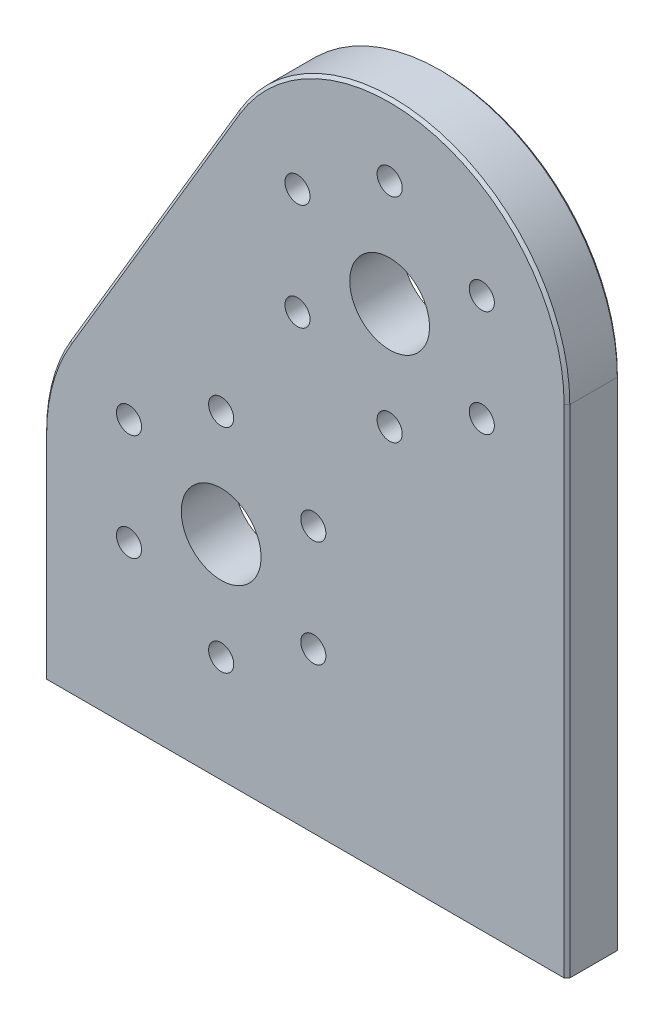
ISO-10303-21;
HEADER;
FILE_DESCRIPTION(('STEP AP214'),'2;1');
FILE_NAME('part.step','',(''),(''),'','','');
FILE_SCHEMA(('AUTOMOTIVE_DESIGN { 1 0 10303 214 1 1 1 1 }'));
ENDSEC;
DATA;
#1=APPLICATION_CONTEXT('core data for automotive mechanical design processes');
#2=APPLICATION_PROTOCOL_DEFINITION('international standard','automotive_design',2000,#1);
#3=PRODUCT_CONTEXT('',#1,'mechanical');
#4=PRODUCT('Part','Part','',(#3));
#5=PRODUCT_RELATED_PRODUCT_CATEGORY('part','',(#4));
#6=PRODUCT_DEFINITION_FORMATION('','',#4);
#7=PRODUCT_DEFINITION_CONTEXT('part definition',#1,'design');
#8=PRODUCT_DEFINITION('design','',#6,#7);
#9=PRODUCT_DEFINITION_SHAPE('','',#8);
#10=(LENGTH_UNIT() NAMED_UNIT(*) SI_UNIT(.MILLI.,.METRE.));
#11=(NAMED_UNIT(*) PLANE_ANGLE_UNIT() SI_UNIT($,.RADIAN.));
#12=(NAMED_UNIT(*) SI_UNIT($,.STERADIAN.) SOLID_ANGLE_UNIT());
#13=UNCERTAINTY_MEASURE_WITH_UNIT(LENGTH_MEASURE(1.E-05),#10,'distance_accuracy_value','');
#14=(GEOMETRIC_REPRESENTATION_CONTEXT(3) GLOBAL_UNCERTAINTY_ASSIGNED_CONTEXT((#13)) GLOBAL_UNIT_ASSIGNED_CONTEXT((#10,
#11,#12)) REPRESENTATION_CONTEXT('',''));
#15=CARTESIAN_POINT('',(0.,0.,0.));
#16=DIRECTION('',(0.,0.,1.));
#17=DIRECTION('',(1.,0.,0.));
#18=AXIS2_PLACEMENT_3D('',#15,#16,#17);
#19=CARTESIAN_POINT('',(30.1625,88.9,4.7625));
#20=DIRECTION('',(0.,0.,1.));
#21=DIRECTION('',(1.,0.,0.));
#22=AXIS2_PLACEMENT_3D('',#19,#20,#21);
#23=PLANE('',#22);
#24=CARTESIAN_POINT('',(30.1625,69.85,4.7625));
#25=DIRECTION('',(0.,0.,1.));
#26=DIRECTION('',(1.,0.,0.));
#27=AXIS2_PLACEMENT_3D('',#24,#25,#26);
#28=CIRCLE('',#27,2.24789999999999);
#29=CARTESIAN_POINT('',(32.4104,69.85,4.7625));
#30=VERTEX_POINT('',#29);
#31=EDGE_CURVE('E472',#30,#30,#28,.T.);
#32=ORIENTED_EDGE('',*,*,#31,.F.);
#33=EDGE_LOOP('',(#32));
#34=FACE_BOUND('',#33,.T.);
#35=CARTESIAN_POINT('',(13.6647160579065,79.375,4.7625));
#36=DIRECTION('',(0.,0.,1.));
#37=DIRECTION('',(1.,0.,0.));
#38=AXIS2_PLACEMENT_3D('',#35,#36,#37);
#39=CIRCLE('',#38,2.24789999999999);
#40=CARTESIAN_POINT('',(15.9126160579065,79.375,4.7625));
#41=VERTEX_POINT('',#40);
#42=EDGE_CURVE('E478',#41,#41,#39,.T.);
#43=ORIENTED_EDGE('',*,*,#42,.F.);
#44=EDGE_LOOP('',(#43));
#45=FACE_BOUND('',#44,.T.);
#46=CARTESIAN_POINT('',(46.6602839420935,98.425,4.7625));
#47=DIRECTION('',(0.,0.,1.));
#48=DIRECTION('',(1.,0.,0.));
#49=AXIS2_PLACEMENT_3D('',#46,#47,#48);
#50=CIRCLE('',#49,2.24789999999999);
#51=CARTESIAN_POINT('',(48.9081839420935,98.425,4.7625));
#52=VERTEX_POINT('',#51);
#53=EDGE_CURVE('E484',#52,#52,#50,.T.);
#54=ORIENTED_EDGE('',*,*,#53,.F.);
#55=EDGE_LOOP('',(#54));
#56=FACE_BOUND('',#55,.T.);
#57=CARTESIAN_POINT('',(30.1625,107.95,4.7625));
#58=DIRECTION('',(0.,0.,1.));
#59=DIRECTION('',(1.,0.,0.));
#60=AXIS2_PLACEMENT_3D('',#57,#58,#59);
#61=CIRCLE('',#60,2.24789999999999);
#62=CARTESIAN_POINT('',(32.4104,107.95,4.7625));
#63=VERTEX_POINT('',#62);
#64=EDGE_CURVE('E490',#63,#63,#61,.T.);
#65=ORIENTED_EDGE('',*,*,#64,.F.);
#66=EDGE_LOOP('',(#65));
#67=FACE_BOUND('',#66,.T.);
#68=CARTESIAN_POINT('',(13.6647160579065,98.425,4.7625));
#69=DIRECTION('',(0.,0.,1.));
#70=DIRECTION('',(1.,0.,0.));
#71=AXIS2_PLACEMENT_3D('',#68,#69,#70);
#72=CIRCLE('',#71,2.24789999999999);
#73=CARTESIAN_POINT('',(15.9126160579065,98.425,4.7625));
#74=VERTEX_POINT('',#73);
#75=EDGE_CURVE('E496',#74,#74,#72,.T.);
#76=ORIENTED_EDGE('',*,*,#75,.F.);
#77=EDGE_LOOP('',(#76));
#78=FACE_BOUND('',#77,.T.);
#79=CARTESIAN_POINT('',(46.6602839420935,79.375,4.7625));
#80=DIRECTION('',(0.,0.,1.));
#81=DIRECTION('',(1.,0.,0.));
#82=AXIS2_PLACEMENT_3D('',#79,#80,#81);
#83=CIRCLE('',#82,2.24789999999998);
#84=CARTESIAN_POINT('',(48.9081839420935,79.375,4.7625));
#85=VERTEX_POINT('',#84);
#86=EDGE_CURVE('E502',#85,#85,#83,.T.);
#87=ORIENTED_EDGE('',*,*,#86,.F.);
#88=EDGE_LOOP('',(#87));
#89=FACE_BOUND('',#88,.T.);
#90=CARTESIAN_POINT('',(16.4977839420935,47.625,4.7625));
#91=DIRECTION('',(0.,0.,1.));
#92=DIRECTION('',(1.,0.,0.));
#93=AXIS2_PLACEMENT_3D('',#90,#91,#92);
#94=CIRCLE('',#93,2.24789999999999);
#95=CARTESIAN_POINT('',(18.7456839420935,47.625,4.7625));
#96=VERTEX_POINT('',#95);
#97=EDGE_CURVE('E508',#96,#96,#94,.T.);
#98=ORIENTED_EDGE('',*,*,#97,.F.);
#99=EDGE_LOOP('',(#98));
#100=FACE_BOUND('',#99,.T.);
#101=CARTESIAN_POINT('',(16.4977839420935,28.575,4.7625));
#102=DIRECTION('',(0.,0.,1.));
#103=DIRECTION('',(1.,0.,0.));
#104=AXIS2_PLACEMENT_3D('',#101,#102,#103);
#105=CIRCLE('',#104,2.24789999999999);
#106=CARTESIAN_POINT('',(18.7456839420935,28.575,4.7625));
#107=VERTEX_POINT('',#106);
#108=EDGE_CURVE('E514',#107,#107,#105,.T.);
#109=ORIENTED_EDGE('',*,*,#108,.F.);
#110=EDGE_LOOP('',(#109));
#111=FACE_BOUND('',#110,.T.);
#112=CARTESIAN_POINT('',(0.,57.15,4.7625));
#113=DIRECTION('',(0.,0.,1.));
#114=DIRECTION('',(1.,0.,0.));
#115=AXIS2_PLACEMENT_3D('',#112,#113,#114);
#116=CIRCLE('',#115,2.24789999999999);
#117=CARTESIAN_POINT('',(2.24789999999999,57.15,4.7625));
#118=VERTEX_POINT('',#117);
#119=EDGE_CURVE('E520',#118,#118,#116,.T.);
#120=ORIENTED_EDGE('',*,*,#119,.F.);
#121=EDGE_LOOP('',(#120));
#122=FACE_BOUND('',#121,.T.);
#123=CARTESIAN_POINT('',(-16.4977839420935,28.575,4.7625));
#124=DIRECTION('',(0.,0.,1.));
#125=DIRECTION('',(1.,0.,0.));
#126=AXIS2_PLACEMENT_3D('',#123,#124,#125);
#127=CIRCLE('',#126,2.24789999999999);
#128=CARTESIAN_POINT('',(-14.2498839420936,28.575,4.7625));
#129=VERTEX_POINT('',#128);
#130=EDGE_CURVE('E526',#129,#129,#127,.T.);
#131=ORIENTED_EDGE('',*,*,#130,.F.);
#132=EDGE_LOOP('',(#131));
#133=FACE_BOUND('',#132,.T.);
#134=CARTESIAN_POINT('',(-16.4977839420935,47.625,4.7625));
#135=DIRECTION('',(0.,0.,1.));
#136=DIRECTION('',(1.,0.,0.));
#137=AXIS2_PLACEMENT_3D('',#134,#135,#136);
#138=CIRCLE('',#137,2.24789999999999);
#139=CARTESIAN_POINT('',(-14.2498839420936,47.625,4.7625));
#140=VERTEX_POINT('',#139);
#141=EDGE_CURVE('E532',#140,#140,#138,.T.);
#142=ORIENTED_EDGE('',*,*,#141,.F.);
#143=EDGE_LOOP('',(#142));
#144=FACE_BOUND('',#143,.T.);
#145=CARTESIAN_POINT('',(0.,19.05,4.7625));
#146=DIRECTION('',(0.,0.,1.));
#147=DIRECTION('',(1.,0.,0.));
#148=AXIS2_PLACEMENT_3D('',#145,#146,#147);
#149=CIRCLE('',#148,2.24789999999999);
#150=CARTESIAN_POINT('',(2.24789999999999,19.05,4.7625));
#151=VERTEX_POINT('',#150);
#152=EDGE_CURVE('E138',#151,#151,#149,.T.);
#153=ORIENTED_EDGE('',*,*,#152,.F.);
#154=EDGE_LOOP('',(#153));
#155=FACE_BOUND('',#154,.T.);
#156=CARTESIAN_POINT('',(0.,38.1,4.7625));
#157=DIRECTION('',(0.,0.,1.));
#158=DIRECTION('',(1.,0.,0.));
#159=AXIS2_PLACEMENT_3D('',#156,#157,#158);
#160=CIRCLE('',#159,7.14375);
#161=CARTESIAN_POINT('',(-7.14375,38.1,4.7625));
#162=VERTEX_POINT('',#161);
#163=EDGE_CURVE('E174',#162,#162,#160,.T.);
#164=ORIENTED_EDGE('',*,*,#163,.F.);
#165=EDGE_LOOP('',(#164));
#166=FACE_BOUND('',#165,.T.);
#167=CARTESIAN_POINT('',(0.,38.1,4.7625));
#168=DIRECTION('',(0.,0.,1.));
#169=DIRECTION('',(1.,0.,0.));
#170=AXIS2_PLACEMENT_3D('',#167,#168,#169);
#171=CIRCLE('',#170,31.242);
#172=CARTESIAN_POINT('',(-26.8635819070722,54.0502517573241,4.7625));
#173=VERTEX_POINT('',#172);
#174=CARTESIAN_POINT('',(-31.242,38.1,4.7625));
#175=VERTEX_POINT('',#174);
#176=EDGE_CURVE('E207',#173,#175,#171,.T.);
#177=ORIENTED_EDGE('',*,*,#176,.T.);
#178=DIRECTION('',(0.,-1.,0.));
#179=VECTOR('',#178,1.);
#180=CARTESIAN_POINT('',(-31.242,0.,4.7625));
#181=LINE('',#180,#179);
#182=CARTESIAN_POINT('',(-31.242,0.,4.7625));
#183=VERTEX_POINT('',#182);
#184=EDGE_CURVE('E209',#175,#183,#181,.T.);
#185=ORIENTED_EDGE('',*,*,#184,.T.);
#186=DIRECTION('',(1.,0.,0.));
#187=VECTOR('',#186,1.);
#188=CARTESIAN_POINT('',(-31.75,0.,4.7625));
#189=LINE('',#188,#187);
#190=CARTESIAN_POINT('',(61.4045,0.,4.7625));
#191=VERTEX_POINT('',#190);
#192=EDGE_CURVE('E180',#183,#191,#189,.T.);
#193=ORIENTED_EDGE('',*,*,#192,.T.);
#194=DIRECTION('',(0.,1.,0.));
#195=VECTOR('',#194,1.);
#196=CARTESIAN_POINT('',(61.4045,88.9,4.7625));
#197=LINE('',#196,#195);
#198=CARTESIAN_POINT('',(61.4045,88.9,4.7625));
#199=VERTEX_POINT('',#198);
#200=EDGE_CURVE('E201',#191,#199,#197,.T.);
#201=ORIENTED_EDGE('',*,*,#200,.T.);
#202=CARTESIAN_POINT('',(30.1625,88.9,4.7625));
#203=DIRECTION('',(0.,0.,1.));
#204=DIRECTION('',(1.,0.,0.));
#205=AXIS2_PLACEMENT_3D('',#202,#203,#204);
#206=CIRCLE('',#205,31.242);
#207=CARTESIAN_POINT('',(3.29891809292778,104.850251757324,4.7625));
#208=VERTEX_POINT('',#207);
#209=EDGE_CURVE('E203',#199,#208,#206,.T.);
#210=ORIENTED_EDGE('',*,*,#209,.T.);
#211=DIRECTION('',(-0.510538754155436,-0.859854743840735,0.));
#212=VECTOR('',#211,1.);
#213=CARTESIAN_POINT('',(-26.8635819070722,54.0502517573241,4.7625));
#214=LINE('',#213,#212);
#215=EDGE_CURVE('E205',#208,#173,#214,.T.);
#216=ORIENTED_EDGE('',*,*,#215,.T.);
#217=EDGE_LOOP('',(#177,#185,#193,#201,#210,#216));
#218=FACE_BOUND('',#217,.T.);
#219=CARTESIAN_POINT('',(30.1625,88.9,4.7625));
#220=DIRECTION('',(0.,0.,1.));
#221=DIRECTION('',(1.,0.,0.));
#222=AXIS2_PLACEMENT_3D('',#219,#220,#221);
#223=CIRCLE('',#222,7.14375);
#224=CARTESIAN_POINT('',(23.01875,88.9,4.7625));
#225=VERTEX_POINT('',#224);
#226=EDGE_CURVE('E168',#225,#225,#223,.T.);
#227=ORIENTED_EDGE('',*,*,#226,.F.);
#228=EDGE_LOOP('',(#227));
#229=FACE_BOUND('',#228,.T.);
#230=ADVANCED_FACE('F36',(#34,#45,#56,#67,#78,#89,#100,#111,#122,#133,#144,#155,#166,#218,#229),
#23,.T.);
#231=CARTESIAN_POINT('',(30.1625,88.9,-4.7625));
#232=DIRECTION('',(0.,0.,1.));
#233=DIRECTION('',(1.,0.,0.));
#234=AXIS2_PLACEMENT_3D('',#231,#232,#233);
#235=PLANE('',#234);
#236=CARTESIAN_POINT('',(30.1625,69.85,-4.7625));
#237=DIRECTION('',(0.,0.,1.));
#238=DIRECTION('',(1.,0.,0.));
#239=AXIS2_PLACEMENT_3D('',#236,#237,#238);
#240=CIRCLE('',#239,2.2479);
#241=CARTESIAN_POINT('',(32.4104,69.85,-4.7625));
#242=VERTEX_POINT('',#241);
#243=EDGE_CURVE('E469',#242,#242,#240,.T.);
#244=ORIENTED_EDGE('',*,*,#243,.T.);
#245=EDGE_LOOP('',(#244));
#246=FACE_BOUND('',#245,.T.);
#247=CARTESIAN_POINT('',(13.6647160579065,79.375,-4.7625));
#248=DIRECTION('',(0.,0.,1.));
#249=DIRECTION('',(1.,0.,0.));
#250=AXIS2_PLACEMENT_3D('',#247,#248,#249);
#251=CIRCLE('',#250,2.2479);
#252=CARTESIAN_POINT('',(15.9126160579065,79.375,-4.7625));
#253=VERTEX_POINT('',#252);
#254=EDGE_CURVE('E475',#253,#253,#251,.T.);
#255=ORIENTED_EDGE('',*,*,#254,.T.);
#256=EDGE_LOOP('',(#255));
#257=FACE_BOUND('',#256,.T.);
#258=CARTESIAN_POINT('',(46.6602839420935,98.425,-4.7625));
#259=DIRECTION('',(0.,0.,1.));
#260=DIRECTION('',(1.,0.,0.));
#261=AXIS2_PLACEMENT_3D('',#258,#259,#260);
#262=CIRCLE('',#261,2.2479);
#263=CARTESIAN_POINT('',(48.9081839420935,98.425,-4.7625));
#264=VERTEX_POINT('',#263);
#265=EDGE_CURVE('E481',#264,#264,#262,.T.);
#266=ORIENTED_EDGE('',*,*,#265,.T.);
#267=EDGE_LOOP('',(#266));
#268=FACE_BOUND('',#267,.T.);
#269=CARTESIAN_POINT('',(30.1625,107.95,-4.7625));
#270=DIRECTION('',(0.,0.,1.));
#271=DIRECTION('',(1.,0.,0.));
#272=AXIS2_PLACEMENT_3D('',#269,#270,#271);
#273=CIRCLE('',#272,2.2479);
#274=CARTESIAN_POINT('',(32.4104,107.95,-4.7625));
#275=VERTEX_POINT('',#274);
#276=EDGE_CURVE('E487',#275,#275,#273,.T.);
#277=ORIENTED_EDGE('',*,*,#276,.T.);
#278=EDGE_LOOP('',(#277));
#279=FACE_BOUND('',#278,.T.);
#280=CARTESIAN_POINT('',(13.6647160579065,98.425,-4.7625));
#281=DIRECTION('',(0.,0.,1.));
#282=DIRECTION('',(1.,0.,0.));
#283=AXIS2_PLACEMENT_3D('',#280,#281,#282);
#284=CIRCLE('',#283,2.2479);
#285=CARTESIAN_POINT('',(15.9126160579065,98.425,-4.7625));
#286=VERTEX_POINT('',#285);
#287=EDGE_CURVE('E493',#286,#286,#284,.T.);
#288=ORIENTED_EDGE('',*,*,#287,.T.);
#289=EDGE_LOOP('',(#288));
#290=FACE_BOUND('',#289,.T.);
#291=CARTESIAN_POINT('',(46.6602839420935,79.375,-4.7625));
#292=DIRECTION('',(0.,0.,1.));
#293=DIRECTION('',(1.,0.,0.));
#294=AXIS2_PLACEMENT_3D('',#291,#292,#293);
#295=CIRCLE('',#294,2.2479);
#296=CARTESIAN_POINT('',(48.9081839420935,79.375,-4.7625));
#297=VERTEX_POINT('',#296);
#298=EDGE_CURVE('E499',#297,#297,#295,.T.);
#299=ORIENTED_EDGE('',*,*,#298,.T.);
#300=EDGE_LOOP('',(#299));
#301=FACE_BOUND('',#300,.T.);
#302=CARTESIAN_POINT('',(16.4977839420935,47.625,-4.7625));
#303=DIRECTION('',(0.,0.,1.));
#304=DIRECTION('',(1.,0.,0.));
#305=AXIS2_PLACEMENT_3D('',#302,#303,#304);
#306=CIRCLE('',#305,2.2479);
#307=CARTESIAN_POINT('',(18.7456839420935,47.625,-4.7625));
#308=VERTEX_POINT('',#307);
#309=EDGE_CURVE('E505',#308,#308,#306,.T.);
#310=ORIENTED_EDGE('',*,*,#309,.T.);
#311=EDGE_LOOP('',(#310));
#312=FACE_BOUND('',#311,.T.);
#313=CARTESIAN_POINT('',(16.4977839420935,28.575,-4.7625));
#314=DIRECTION('',(0.,0.,1.));
#315=DIRECTION('',(1.,0.,0.));
#316=AXIS2_PLACEMENT_3D('',#313,#314,#315);
#317=CIRCLE('',#316,2.2479);
#318=CARTESIAN_POINT('',(18.7456839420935,28.575,-4.7625));
#319=VERTEX_POINT('',#318);
#320=EDGE_CURVE('E511',#319,#319,#317,.T.);
#321=ORIENTED_EDGE('',*,*,#320,.T.);
#322=EDGE_LOOP('',(#321));
#323=FACE_BOUND('',#322,.T.);
#324=CARTESIAN_POINT('',(0.,57.15,-4.7625));
#325=DIRECTION('',(0.,0.,1.));
#326=DIRECTION('',(1.,0.,0.));
#327=AXIS2_PLACEMENT_3D('',#324,#325,#326);
#328=CIRCLE('',#327,2.2479);
#329=CARTESIAN_POINT('',(2.2479,57.15,-4.7625));
#330=VERTEX_POINT('',#329);
#331=EDGE_CURVE('E517',#330,#330,#328,.T.);
#332=ORIENTED_EDGE('',*,*,#331,.T.);
#333=EDGE_LOOP('',(#332));
#334=FACE_BOUND('',#333,.T.);
#335=CARTESIAN_POINT('',(-16.4977839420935,28.575,-4.7625));
#336=DIRECTION('',(0.,0.,1.));
#337=DIRECTION('',(1.,0.,0.));
#338=AXIS2_PLACEMENT_3D('',#335,#336,#337);
#339=CIRCLE('',#338,2.2479);
#340=CARTESIAN_POINT('',(-14.2498839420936,28.575,-4.7625));
#341=VERTEX_POINT('',#340);
#342=EDGE_CURVE('E523',#341,#341,#339,.T.);
#343=ORIENTED_EDGE('',*,*,#342,.T.);
#344=EDGE_LOOP('',(#343));
#345=FACE_BOUND('',#344,.T.);
#346=CARTESIAN_POINT('',(-16.4977839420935,47.625,-4.7625));
#347=DIRECTION('',(0.,0.,1.));
#348=DIRECTION('',(1.,0.,0.));
#349=AXIS2_PLACEMENT_3D('',#346,#347,#348);
#350=CIRCLE('',#349,2.2479);
#351=CARTESIAN_POINT('',(-14.2498839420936,47.625,-4.7625));
#352=VERTEX_POINT('',#351);
#353=EDGE_CURVE('E529',#352,#352,#350,.T.);
#354=ORIENTED_EDGE('',*,*,#353,.T.);
#355=EDGE_LOOP('',(#354));
#356=FACE_BOUND('',#355,.T.);
#357=CARTESIAN_POINT('',(0.,19.05,-4.7625));
#358=DIRECTION('',(0.,0.,1.));
#359=DIRECTION('',(1.,0.,0.));
#360=AXIS2_PLACEMENT_3D('',#357,#358,#359);
#361=CIRCLE('',#360,2.2479);
#362=CARTESIAN_POINT('',(2.2479,19.05,-4.7625));
#363=VERTEX_POINT('',#362);
#364=EDGE_CURVE('E144',#363,#363,#361,.T.);
#365=ORIENTED_EDGE('',*,*,#364,.T.);
#366=EDGE_LOOP('',(#365));
#367=FACE_BOUND('',#366,.T.);
#368=CARTESIAN_POINT('',(0.,38.1,-4.7625));
#369=DIRECTION('',(0.,0.,1.));
#370=DIRECTION('',(1.,0.,0.));
#371=AXIS2_PLACEMENT_3D('',#368,#369,#370);
#372=CIRCLE('',#371,7.14375);
#373=CARTESIAN_POINT('',(-7.14375,38.1,-4.7625));
#374=VERTEX_POINT('',#373);
#375=EDGE_CURVE('E171',#374,#374,#372,.T.);
#376=ORIENTED_EDGE('',*,*,#375,.T.);
#377=EDGE_LOOP('',(#376));
#378=FACE_BOUND('',#377,.T.);
#379=DIRECTION('',(1.,0.,0.));
#380=VECTOR('',#379,1.);
#381=CARTESIAN_POINT('',(-31.75,0.,-4.7625));
#382=LINE('',#381,#380);
#383=CARTESIAN_POINT('',(-31.242,0.,-4.7625));
#384=VERTEX_POINT('',#383);
#385=CARTESIAN_POINT('',(61.4045,0.,-4.76250000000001));
#386=VERTEX_POINT('',#385);
#387=EDGE_CURVE('E177',#384,#386,#382,.T.);
#388=ORIENTED_EDGE('',*,*,#387,.F.);
#389=DIRECTION('',(0.,1.,0.));
#390=VECTOR('',#389,1.);
#391=CARTESIAN_POINT('',(-31.242,88.9,-4.7625));
#392=LINE('',#391,#390);
#393=CARTESIAN_POINT('',(-31.242,38.1,-4.7625));
#394=VERTEX_POINT('',#393);
#395=EDGE_CURVE('E11',#384,#394,#392,.T.);
#396=ORIENTED_EDGE('',*,*,#395,.T.);
#397=CARTESIAN_POINT('',(0.,38.1,-4.7625));
#398=DIRECTION('',(0.,0.,1.));
#399=DIRECTION('',(1.,0.,0.));
#400=AXIS2_PLACEMENT_3D('',#397,#398,#399);
#401=CIRCLE('',#400,31.242);
#402=CARTESIAN_POINT('',(-26.8635819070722,54.0502517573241,-4.7625));
#403=VERTEX_POINT('',#402);
#404=EDGE_CURVE('E45',#394,#403,#401,.F.);
#405=ORIENTED_EDGE('',*,*,#404,.T.);
#406=DIRECTION('',(0.510538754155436,0.859854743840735,0.));
#407=VECTOR('',#406,1.);
#408=CARTESIAN_POINT('',(3.29891809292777,104.850251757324,-4.7625));
#409=LINE('',#408,#407);
#410=CARTESIAN_POINT('',(3.29891809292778,104.850251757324,-4.7625));
#411=VERTEX_POINT('',#410);
#412=EDGE_CURVE('E245',#403,#411,#409,.T.);
#413=ORIENTED_EDGE('',*,*,#412,.T.);
#414=CARTESIAN_POINT('',(30.1625,88.9,-4.7625));
#415=DIRECTION('',(0.,0.,1.));
#416=DIRECTION('',(1.,0.,0.));
#417=AXIS2_PLACEMENT_3D('',#414,#415,#416);
#418=CIRCLE('',#417,31.242);
#419=CARTESIAN_POINT('',(61.4045,88.9,-4.7625));
#420=VERTEX_POINT('',#419);
#421=EDGE_CURVE('E243',#411,#420,#418,.F.);
#422=ORIENTED_EDGE('',*,*,#421,.T.);
#423=DIRECTION('',(0.,-1.,0.));
#424=VECTOR('',#423,1.);
#425=CARTESIAN_POINT('',(61.4045,88.9,-4.7625));
#426=LINE('',#425,#424);
#427=EDGE_CURVE('E241',#420,#386,#426,.T.);
#428=ORIENTED_EDGE('',*,*,#427,.T.);
#429=EDGE_LOOP('',(#388,#396,#405,#413,#422,#428));
#430=FACE_BOUND('',#429,.T.);
#431=CARTESIAN_POINT('',(30.1625,88.9,-4.7625));
#432=DIRECTION('',(0.,0.,1.));
#433=DIRECTION('',(1.,0.,0.));
#434=AXIS2_PLACEMENT_3D('',#431,#432,#433);
#435=CIRCLE('',#434,7.14375);
#436=CARTESIAN_POINT('',(23.01875,88.9,-4.7625));
#437=VERTEX_POINT('',#436);
#438=EDGE_CURVE('E165',#437,#437,#435,.T.);
#439=ORIENTED_EDGE('',*,*,#438,.T.);
#440=EDGE_LOOP('',(#439));
#441=FACE_BOUND('',#440,.T.);
#442=ADVANCED_FACE('F281',(#246,#257,#268,#279,#290,#301,#312,#323,#334,#345,#356,#367,#378,
#430,#441),#235,.F.);
#443=CARTESIAN_POINT('',(30.1625,88.9,4.7625));
#444=DIRECTION('',(0.,0.,-1.));
#445=DIRECTION('',(-1.,0.,0.));
#446=AXIS2_PLACEMENT_3D('',#443,#444,#445);
#447=CYLINDRICAL_SURFACE('',#446,31.75);
#448=DIRECTION('',(0.,0.,-1.));
#449=VECTOR('',#448,1.);
#450=CARTESIAN_POINT('',(2.86211188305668,105.109605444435,4.7625));
#451=LINE('',#450,#449);
#452=CARTESIAN_POINT('',(2.86211188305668,105.109605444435,4.25449999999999));
#453=VERTEX_POINT('',#452);
#454=CARTESIAN_POINT('',(2.86211188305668,105.109605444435,-4.25450000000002));
#455=VERTEX_POINT('',#454);
#456=EDGE_CURVE('E198',#453,#455,#451,.T.);
#457=ORIENTED_EDGE('',*,*,#456,.F.);
#458=CARTESIAN_POINT('',(30.1625,88.9,4.25449999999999));
#459=DIRECTION('',(0.,0.,1.));
#460=DIRECTION('',(1.,0.,0.));
#461=AXIS2_PLACEMENT_3D('',#458,#459,#460);
#462=CIRCLE('',#461,31.75);
#463=CARTESIAN_POINT('',(61.9125,88.9,4.25449999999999));
#464=VERTEX_POINT('',#463);
#465=EDGE_CURVE('E235',#453,#464,#462,.F.);
#466=ORIENTED_EDGE('',*,*,#465,.T.);
#467=DIRECTION('',(0.,0.,-1.));
#468=VECTOR('',#467,1.);
#469=CARTESIAN_POINT('',(61.9125,88.9,4.7625));
#470=LINE('',#469,#468);
#471=CARTESIAN_POINT('',(61.9125,88.9,-4.25450000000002));
#472=VERTEX_POINT('',#471);
#473=EDGE_CURVE('E183',#464,#472,#470,.T.);
#474=ORIENTED_EDGE('',*,*,#473,.T.);
#475=CARTESIAN_POINT('',(30.1625,88.9,-4.25450000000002));
#476=DIRECTION('',(0.,0.,1.));
#477=DIRECTION('',(1.,0.,0.));
#478=AXIS2_PLACEMENT_3D('',#475,#476,#477);
#479=CIRCLE('',#478,31.75);
#480=EDGE_CURVE('E233',#472,#455,#479,.T.);
#481=ORIENTED_EDGE('',*,*,#480,.T.);
#482=EDGE_LOOP('',(#457,#466,#474,#481));
#483=FACE_BOUND('',#482,.T.);
#484=ADVANCED_FACE('F334',(#483),#447,.T.);
#485=CARTESIAN_POINT('',(-27.3003881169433,54.3096054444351,4.7625));
#486=DIRECTION('',(0.859854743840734,-0.510538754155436,0.));
#487=DIRECTION('',(0.510538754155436,0.859854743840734,0.));
#488=AXIS2_PLACEMENT_3D('',#485,#486,#487);
#489=PLANE('',#488);
#490=DIRECTION('',(0.,0.,-1.));
#491=VECTOR('',#490,1.);
#492=CARTESIAN_POINT('',(-27.3003881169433,54.3096054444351,4.7625));
#493=LINE('',#492,#491);
#494=CARTESIAN_POINT('',(-27.3003881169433,54.3096054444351,4.25449999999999));
#495=VERTEX_POINT('',#494);
#496=CARTESIAN_POINT('',(-27.3003881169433,54.3096054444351,-4.25450000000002));
#497=VERTEX_POINT('',#496);
#498=EDGE_CURVE('E195',#495,#497,#493,.T.);
#499=ORIENTED_EDGE('',*,*,#498,.F.);
#500=DIRECTION('',(0.510538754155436,0.859854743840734,0.));
#501=VECTOR('',#500,1.);
#502=CARTESIAN_POINT('',(2.86211188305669,105.109605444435,4.25449999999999));
#503=LINE('',#502,#501);
#504=EDGE_CURVE('E231',#495,#453,#503,.T.);
#505=ORIENTED_EDGE('',*,*,#504,.T.);
#506=ORIENTED_EDGE('',*,*,#456,.T.);
#507=DIRECTION('',(-0.510538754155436,-0.859854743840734,0.));
#508=VECTOR('',#507,1.);
#509=CARTESIAN_POINT('',(-27.3003881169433,54.3096054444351,-4.25450000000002));
#510=LINE('',#509,#508);
#511=EDGE_CURVE('E229',#455,#497,#510,.T.);
#512=ORIENTED_EDGE('',*,*,#511,.T.);
#513=EDGE_LOOP('',(#499,#505,#506,#512));
#514=FACE_BOUND('',#513,.T.);
#515=ADVANCED_FACE('F305',(#514),#489,.F.);
#516=CARTESIAN_POINT('',(0.,38.1,4.7625));
#517=DIRECTION('',(0.,0.,-1.));
#518=DIRECTION('',(-1.,0.,0.));
#519=AXIS2_PLACEMENT_3D('',#516,#517,#518);
#520=CYLINDRICAL_SURFACE('',#519,31.75);
#521=DIRECTION('',(0.,0.,-1.));
#522=VECTOR('',#521,1.);
#523=CARTESIAN_POINT('',(-31.75,38.1,4.7625));
#524=LINE('',#523,#522);
#525=CARTESIAN_POINT('',(-31.75,38.1,4.25449999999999));
#526=VERTEX_POINT('',#525);
#527=CARTESIAN_POINT('',(-31.75,38.1,-4.25450000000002));
#528=VERTEX_POINT('',#527);
#529=EDGE_CURVE('E192',#526,#528,#524,.T.);
#530=ORIENTED_EDGE('',*,*,#529,.F.);
#531=CARTESIAN_POINT('',(0.,38.1,4.25449999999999));
#532=DIRECTION('',(0.,0.,1.));
#533=DIRECTION('',(1.,0.,0.));
#534=AXIS2_PLACEMENT_3D('',#531,#532,#533);
#535=CIRCLE('',#534,31.75);
#536=EDGE_CURVE('E227',#526,#495,#535,.F.);
#537=ORIENTED_EDGE('',*,*,#536,.T.);
#538=ORIENTED_EDGE('',*,*,#498,.T.);
#539=CARTESIAN_POINT('',(0.,38.1,-4.25450000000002));
#540=DIRECTION('',(0.,0.,1.));
#541=DIRECTION('',(1.,0.,0.));
#542=AXIS2_PLACEMENT_3D('',#539,#540,#541);
#543=CIRCLE('',#542,31.75);
#544=EDGE_CURVE('E225',#497,#528,#543,.T.);
#545=ORIENTED_EDGE('',*,*,#544,.T.);
#546=EDGE_LOOP('',(#530,#537,#538,#545));
#547=FACE_BOUND('',#546,.T.);
#548=ADVANCED_FACE('F308',(#547),#520,.T.);
#549=CARTESIAN_POINT('',(-31.75,38.1,4.7625));
#550=DIRECTION('',(1.,0.,0.));
#551=DIRECTION('',(0.,0.,-1.));
#552=AXIS2_PLACEMENT_3D('',#549,#550,#551);
#553=PLANE('',#552);
#554=DIRECTION('',(0.,0.,-1.));
#555=VECTOR('',#554,1.);
#556=CARTESIAN_POINT('',(-31.75,0.,4.7625));
#557=LINE('',#556,#555);
#558=CARTESIAN_POINT('',(-31.75,0.,4.25449999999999));
#559=VERTEX_POINT('',#558);
#560=CARTESIAN_POINT('',(-31.75,0.,-4.25450000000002));
#561=VERTEX_POINT('',#560);
#562=EDGE_CURVE('E189',#559,#561,#557,.T.);
#563=ORIENTED_EDGE('',*,*,#562,.F.);
#564=DIRECTION('',(0.,1.,0.));
#565=VECTOR('',#564,1.);
#566=CARTESIAN_POINT('',(-31.75,38.1,4.25449999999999));
#567=LINE('',#566,#565);
#568=EDGE_CURVE('E223',#559,#526,#567,.T.);
#569=ORIENTED_EDGE('',*,*,#568,.T.);
#570=ORIENTED_EDGE('',*,*,#529,.T.);
#571=DIRECTION('',(0.,-1.,0.));
#572=VECTOR('',#571,1.);
#573=CARTESIAN_POINT('',(-31.75,38.1,-4.25450000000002));
#574=LINE('',#573,#572);
#575=EDGE_CURVE('E220',#528,#561,#574,.T.);
#576=ORIENTED_EDGE('',*,*,#575,.T.);
#577=EDGE_LOOP('',(#563,#569,#570,#576));
#578=FACE_BOUND('',#577,.T.);
#579=ADVANCED_FACE('F292',(#578),#553,.F.);
#580=CARTESIAN_POINT('',(-31.75,0.,4.7625));
#581=DIRECTION('',(0.,1.,0.));
#582=DIRECTION('',(0.,0.,1.));
#583=AXIS2_PLACEMENT_3D('',#580,#581,#582);
#584=PLANE('',#583);
#585=CARTESIAN_POINT('',(50.8,0.,0.));
#586=DIRECTION('',(0.,-1.,0.));
#587=DIRECTION('',(0.,0.,-1.));
#588=AXIS2_PLACEMENT_3D('',#585,#586,#587);
#589=CIRCLE('',#588,2.38125);
#590=CARTESIAN_POINT('',(50.8,0.,-2.38125));
#591=VERTEX_POINT('',#590);
#592=EDGE_CURVE('E260',#591,#591,#589,.T.);
#593=ORIENTED_EDGE('',*,*,#592,.F.);
#594=EDGE_LOOP('',(#593));
#595=FACE_BOUND('',#594,.T.);
#596=CARTESIAN_POINT('',(0.,0.,0.));
#597=DIRECTION('',(0.,-1.,0.));
#598=DIRECTION('',(0.,0.,-1.));
#599=AXIS2_PLACEMENT_3D('',#596,#597,#598);
#600=CIRCLE('',#599,2.38125);
#601=CARTESIAN_POINT('',(0.,0.,-2.38125));
#602=VERTEX_POINT('',#601);
#603=EDGE_CURVE('E459',#602,#602,#600,.T.);
#604=ORIENTED_EDGE('',*,*,#603,.F.);
#605=EDGE_LOOP('',(#604));
#606=FACE_BOUND('',#605,.T.);
#607=CARTESIAN_POINT('',(25.4,0.,0.));
#608=DIRECTION('',(0.,-1.,0.));
#609=DIRECTION('',(0.,0.,-1.));
#610=AXIS2_PLACEMENT_3D('',#607,#608,#609);
#611=CIRCLE('',#610,2.0828);
#612=CARTESIAN_POINT('',(25.4,0.,-2.0828));
#613=VERTEX_POINT('',#612);
#614=EDGE_CURVE('E150',#613,#613,#611,.T.);
#615=ORIENTED_EDGE('',*,*,#614,.F.);
#616=EDGE_LOOP('',(#615));
#617=FACE_BOUND('',#616,.T.);
#618=CARTESIAN_POINT('',(-25.4,0.,0.));
#619=DIRECTION('',(0.,-1.,0.));
#620=DIRECTION('',(0.,0.,-1.));
#621=AXIS2_PLACEMENT_3D('',#618,#619,#620);
#622=CIRCLE('',#621,2.0828);
#623=CARTESIAN_POINT('',(-25.4,0.,-2.0828));
#624=VERTEX_POINT('',#623);
#625=EDGE_CURVE('E162',#624,#624,#622,.T.);
#626=ORIENTED_EDGE('',*,*,#625,.F.);
#627=EDGE_LOOP('',(#626));
#628=FACE_BOUND('',#627,.T.);
#629=ORIENTED_EDGE('',*,*,#192,.F.);
#630=DIRECTION('',(-0.707106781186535,0.,-0.70710678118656));
#631=VECTOR('',#630,1.);
#632=CARTESIAN_POINT('',(-31.242,0.,4.7625));
#633=LINE('',#632,#631);
#634=EDGE_CURVE('E218',#183,#559,#633,.T.);
#635=ORIENTED_EDGE('',*,*,#634,.T.);
#636=ORIENTED_EDGE('',*,*,#562,.T.);
#637=DIRECTION('',(-0.707106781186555,0.,0.70710678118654));
#638=VECTOR('',#637,1.);
#639=CARTESIAN_POINT('',(-31.75,0.,-4.25450000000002));
#640=LINE('',#639,#638);
#641=EDGE_CURVE('E214',#561,#384,#640,.F.);
#642=ORIENTED_EDGE('',*,*,#641,.T.);
#643=ORIENTED_EDGE('',*,*,#387,.T.);
#644=DIRECTION('',(-0.707106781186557,0.,-0.707106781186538));
#645=VECTOR('',#644,1.);
#646=CARTESIAN_POINT('',(61.9125,0.,-4.25450000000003));
#647=LINE('',#646,#645);
#648=CARTESIAN_POINT('',(61.9125,0.,-4.25450000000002));
#649=VERTEX_POINT('',#648);
#650=EDGE_CURVE('E212',#386,#649,#647,.F.);
#651=ORIENTED_EDGE('',*,*,#650,.T.);
#652=DIRECTION('',(0.,0.,-1.));
#653=VECTOR('',#652,1.);
#654=CARTESIAN_POINT('',(61.9125,0.,4.7625));
#655=LINE('',#654,#653);
#656=CARTESIAN_POINT('',(61.9125,0.,4.25449999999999));
#657=VERTEX_POINT('',#656);
#658=EDGE_CURVE('E186',#657,#649,#655,.T.);
#659=ORIENTED_EDGE('',*,*,#658,.F.);
#660=DIRECTION('',(-0.707106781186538,0.,0.707106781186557));
#661=VECTOR('',#660,1.);
#662=CARTESIAN_POINT('',(61.4045,0.,4.76250000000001));
#663=LINE('',#662,#661);
#664=EDGE_CURVE('E216',#657,#191,#663,.T.);
#665=ORIENTED_EDGE('',*,*,#664,.T.);
#666=EDGE_LOOP('',(#629,#635,#636,#642,#643,#651,#659,#665));
#667=FACE_BOUND('',#666,.T.);
#668=ADVANCED_FACE('F285',(#595,#606,#617,#628,#667),#584,.F.);
#669=CARTESIAN_POINT('',(61.9125,88.9,4.7625));
#670=DIRECTION('',(-1.,0.,0.));
#671=DIRECTION('',(0.,-1.,0.));
#672=AXIS2_PLACEMENT_3D('',#669,#670,#671);
#673=PLANE('',#672);
#674=ORIENTED_EDGE('',*,*,#473,.F.);
#675=DIRECTION('',(0.,-1.,0.));
#676=VECTOR('',#675,1.);
#677=CARTESIAN_POINT('',(61.9125,0.,4.25449999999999));
#678=LINE('',#677,#676);
#679=EDGE_CURVE('E239',#464,#657,#678,.T.);
#680=ORIENTED_EDGE('',*,*,#679,.T.);
#681=ORIENTED_EDGE('',*,*,#658,.T.);
#682=DIRECTION('',(0.,1.,0.));
#683=VECTOR('',#682,1.);
#684=CARTESIAN_POINT('',(61.9125,88.9,-4.25450000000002));
#685=LINE('',#684,#683);
#686=EDGE_CURVE('E237',#649,#472,#685,.T.);
#687=ORIENTED_EDGE('',*,*,#686,.T.);
#688=EDGE_LOOP('',(#674,#680,#681,#687));
#689=FACE_BOUND('',#688,.T.);
#690=ADVANCED_FACE('F337',(#689),#673,.F.);
#691=CARTESIAN_POINT('',(0.,38.1,4.7625));
#692=DIRECTION('',(0.,0.,-1.));
#693=DIRECTION('',(-1.,0.,0.));
#694=AXIS2_PLACEMENT_3D('',#691,#692,#693);
#695=CYLINDRICAL_SURFACE('',#694,7.14375);
#696=CARTESIAN_POINT('',(-7.14375,38.1,4.7625));
#697=CARTESIAN_POINT('',(-7.14375,38.1,4.66328125));
#698=CARTESIAN_POINT('',(-7.14375,38.1,4.5640625));
#699=CARTESIAN_POINT('',(-7.14375,38.1,4.365625));
#700=CARTESIAN_POINT('',(-7.14375,38.1,4.26640625));
#701=CARTESIAN_POINT('',(-7.14375,38.1,4.06796875));
#702=CARTESIAN_POINT('',(-7.14375,38.1,3.96875));
#703=CARTESIAN_POINT('',(-7.14375,38.1,3.7703125));
#704=CARTESIAN_POINT('',(-7.14375,38.1,3.67109375));
#705=CARTESIAN_POINT('',(-7.14375,38.1,3.47265625));
#706=CARTESIAN_POINT('',(-7.14375,38.1,3.3734375));
#707=CARTESIAN_POINT('',(-7.14375,38.1,3.175));
#708=CARTESIAN_POINT('',(-7.14375,38.1,3.07578125));
#709=CARTESIAN_POINT('',(-7.14375,38.1,2.87734375));
#710=CARTESIAN_POINT('',(-7.14375,38.1,2.778125));
#711=CARTESIAN_POINT('',(-7.14375,38.1,2.5796875));
#712=CARTESIAN_POINT('',(-7.14375,38.1,2.48046875));
#713=CARTESIAN_POINT('',(-7.14375,38.1,2.28203125));
#714=CARTESIAN_POINT('',(-7.14375,38.1,2.1828125));
#715=CARTESIAN_POINT('',(-7.14375,38.1,1.984375));
#716=CARTESIAN_POINT('',(-7.14375,38.1,1.88515625));
#717=CARTESIAN_POINT('',(-7.14375,38.1,1.68671875));
#718=CARTESIAN_POINT('',(-7.14375,38.1,1.5875));
#719=CARTESIAN_POINT('',(-7.14375,38.1,1.3890625));
#720=CARTESIAN_POINT('',(-7.14375,38.1,1.28984375));
#721=CARTESIAN_POINT('',(-7.14375,38.1,1.09140625));
#722=CARTESIAN_POINT('',(-7.14375,38.1,0.992187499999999));
#723=CARTESIAN_POINT('',(-7.14375,38.1,0.79375));
#724=CARTESIAN_POINT('',(-7.14375,38.1,0.69453125));
#725=CARTESIAN_POINT('',(-7.14375,38.1,0.49609375));
#726=CARTESIAN_POINT('',(-7.14375,38.1,0.396875));
#727=CARTESIAN_POINT('',(-7.14375,38.1,0.1984375));
#728=CARTESIAN_POINT('',(-7.14375,38.1,0.0992187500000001));
#729=CARTESIAN_POINT('',(-7.14375,38.1,-0.0992187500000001));
#730=CARTESIAN_POINT('',(-7.14375,38.1,-0.1984375));
#731=CARTESIAN_POINT('',(-7.14375,38.1,-0.396875));
#732=CARTESIAN_POINT('',(-7.14375,38.1,-0.49609375));
#733=CARTESIAN_POINT('',(-7.14375,38.1,-0.69453125));
#734=CARTESIAN_POINT('',(-7.14375,38.1,-0.793750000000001));
#735=CARTESIAN_POINT('',(-7.14375,38.1,-0.992187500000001));
#736=CARTESIAN_POINT('',(-7.14375,38.1,-1.09140625));
#737=CARTESIAN_POINT('',(-7.14375,38.1,-1.28984375));
#738=CARTESIAN_POINT('',(-7.14375,38.1,-1.3890625));
#739=CARTESIAN_POINT('',(-7.14375,38.1,-1.5875));
#740=CARTESIAN_POINT('',(-7.14375,38.1,-1.68671875));
#741=CARTESIAN_POINT('',(-7.14375,38.1,-1.88515625));
#742=CARTESIAN_POINT('',(-7.14375,38.1,-1.984375));
#743=CARTESIAN_POINT('',(-7.14375,38.1,-2.1828125));
#744=CARTESIAN_POINT('',(-7.14375,38.1,-2.28203125));
#745=CARTESIAN_POINT('',(-7.14375,38.1,-2.48046875));
#746=CARTESIAN_POINT('',(-7.14375,38.1,-2.5796875));
#747=CARTESIAN_POINT('',(-7.14375,38.1,-2.778125));
#748=CARTESIAN_POINT('',(-7.14375,38.1,-2.87734375));
#749=CARTESIAN_POINT('',(-7.14375,38.1,-3.07578125));
#750=CARTESIAN_POINT('',(-7.14375,38.1,-3.175));
#751=CARTESIAN_POINT('',(-7.14375,38.1,-3.3734375));
#752=CARTESIAN_POINT('',(-7.14375,38.1,-3.47265625));
#753=CARTESIAN_POINT('',(-7.14375,38.1,-3.67109375));
#754=CARTESIAN_POINT('',(-7.14375,38.1,-3.7703125));
#755=CARTESIAN_POINT('',(-7.14375,38.1,-3.96875));
#756=CARTESIAN_POINT('',(-7.14375,38.1,-4.06796875));
#757=CARTESIAN_POINT('',(-7.14375,38.1,-4.26640625));
#758=CARTESIAN_POINT('',(-7.14375,38.1,-4.365625));
#759=CARTESIAN_POINT('',(-7.14375,38.1,-4.5640625));
#760=CARTESIAN_POINT('',(-7.14375,38.1,-4.66328125));
#761=CARTESIAN_POINT('',(-7.14375,38.1,-4.7625));
#762=B_SPLINE_CURVE_WITH_KNOTS('',3,(#696,#697,#698,#699,#700,#701,#702,#703,#704,#705,#706,
#707,#708,#709,#710,#711,#712,#713,#714,#715,#716,#717,#718,#719,#720,#721,#722,#723,#724,#725,
#726,#727,#728,#729,#730,#731,#732,#733,#734,#735,#736,#737,#738,#739,#740,#741,#742,#743,#744,
#745,#746,#747,#748,#749,#750,#751,#752,#753,#754,#755,#756,#757,#758,#759,#760,#761),
.UNSPECIFIED.,.F.,.F.,(4,2,2,2,2,2,2,2,2,2,2,2,2,2,2,2,2,2,2,2,2,2,2,2,2,2,2,2,2,2,2,2,4),(0.,
0.29765625,0.5953125,0.892968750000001,1.190625,1.48828125,1.7859375,2.08359375,2.38125,
2.67890625,2.9765625,3.27421875,3.571875,3.86953125,4.1671875,4.46484375,4.7625,5.06015625,
5.3578125,5.65546875,5.953125,6.25078125,6.5484375,6.84609375,7.14375,7.44140625,7.7390625,
8.03671875,8.334375,8.63203125,8.9296875,9.22734375,9.525),.UNSPECIFIED.);
#763=EDGE_CURVE('BSEAM339',#162,#374,#762,.T.);
#764=ORIENTED_EDGE('',*,*,#163,.T.);
#765=ORIENTED_EDGE('',*,*,#375,.F.);
#766=ORIENTED_EDGE('',*,*,#763,.T.);
#767=ORIENTED_EDGE('',*,*,#763,.F.);
#768=EDGE_LOOP('',(#764,#766,#765,#767));
#769=FACE_BOUND('',#768,.T.);
#770=ADVANCED_FACE('F339',(#769),#695,.F.);
#771=CARTESIAN_POINT('',(30.1625,88.9,4.7625));
#772=DIRECTION('',(0.,0.,-1.));
#773=DIRECTION('',(-1.,0.,0.));
#774=AXIS2_PLACEMENT_3D('',#771,#772,#773);
#775=CYLINDRICAL_SURFACE('',#774,7.14375);
#776=CARTESIAN_POINT('',(23.01875,88.9,4.7625));
#777=CARTESIAN_POINT('',(23.01875,88.9,4.66328125));
#778=CARTESIAN_POINT('',(23.01875,88.9,4.5640625));
#779=CARTESIAN_POINT('',(23.01875,88.9,4.365625));
#780=CARTESIAN_POINT('',(23.01875,88.9,4.26640625));
#781=CARTESIAN_POINT('',(23.01875,88.9,4.06796875));
#782=CARTESIAN_POINT('',(23.01875,88.9,3.96875));
#783=CARTESIAN_POINT('',(23.01875,88.9,3.7703125));
#784=CARTESIAN_POINT('',(23.01875,88.9,3.67109375));
#785=CARTESIAN_POINT('',(23.01875,88.9,3.47265625));
#786=CARTESIAN_POINT('',(23.01875,88.9,3.3734375));
#787=CARTESIAN_POINT('',(23.01875,88.9,3.175));
#788=CARTESIAN_POINT('',(23.01875,88.9,3.07578125));
#789=CARTESIAN_POINT('',(23.01875,88.9,2.87734375));
#790=CARTESIAN_POINT('',(23.01875,88.9,2.778125));
#791=CARTESIAN_POINT('',(23.01875,88.9,2.5796875));
#792=CARTESIAN_POINT('',(23.01875,88.9,2.48046875));
#793=CARTESIAN_POINT('',(23.01875,88.9,2.28203125));
#794=CARTESIAN_POINT('',(23.01875,88.9,2.1828125));
#795=CARTESIAN_POINT('',(23.01875,88.9,1.984375));
#796=CARTESIAN_POINT('',(23.01875,88.9,1.88515625));
#797=CARTESIAN_POINT('',(23.01875,88.9,1.68671875));
#798=CARTESIAN_POINT('',(23.01875,88.9,1.5875));
#799=CARTESIAN_POINT('',(23.01875,88.9,1.3890625));
#800=CARTESIAN_POINT('',(23.01875,88.9,1.28984375));
#801=CARTESIAN_POINT('',(23.01875,88.9,1.09140625));
#802=CARTESIAN_POINT('',(23.01875,88.9,0.992187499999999));
#803=CARTESIAN_POINT('',(23.01875,88.9,0.79375));
#804=CARTESIAN_POINT('',(23.01875,88.9,0.69453125));
#805=CARTESIAN_POINT('',(23.01875,88.9,0.49609375));
#806=CARTESIAN_POINT('',(23.01875,88.9,0.396875));
#807=CARTESIAN_POINT('',(23.01875,88.9,0.1984375));
#808=CARTESIAN_POINT('',(23.01875,88.9,0.0992187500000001));
#809=CARTESIAN_POINT('',(23.01875,88.9,-0.0992187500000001));
#810=CARTESIAN_POINT('',(23.01875,88.9,-0.1984375));
#811=CARTESIAN_POINT('',(23.01875,88.9,-0.396875));
#812=CARTESIAN_POINT('',(23.01875,88.9,-0.49609375));
#813=CARTESIAN_POINT('',(23.01875,88.9,-0.69453125));
#814=CARTESIAN_POINT('',(23.01875,88.9,-0.793750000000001));
#815=CARTESIAN_POINT('',(23.01875,88.9,-0.992187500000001));
#816=CARTESIAN_POINT('',(23.01875,88.9,-1.09140625));
#817=CARTESIAN_POINT('',(23.01875,88.9,-1.28984375));
#818=CARTESIAN_POINT('',(23.01875,88.9,-1.3890625));
#819=CARTESIAN_POINT('',(23.01875,88.9,-1.5875));
#820=CARTESIAN_POINT('',(23.01875,88.9,-1.68671875));
#821=CARTESIAN_POINT('',(23.01875,88.9,-1.88515625));
#822=CARTESIAN_POINT('',(23.01875,88.9,-1.984375));
#823=CARTESIAN_POINT('',(23.01875,88.9,-2.1828125));
#824=CARTESIAN_POINT('',(23.01875,88.9,-2.28203125));
#825=CARTESIAN_POINT('',(23.01875,88.9,-2.48046875));
#826=CARTESIAN_POINT('',(23.01875,88.9,-2.5796875));
#827=CARTESIAN_POINT('',(23.01875,88.9,-2.778125));
#828=CARTESIAN_POINT('',(23.01875,88.9,-2.87734375));
#829=CARTESIAN_POINT('',(23.01875,88.9,-3.07578125));
#830=CARTESIAN_POINT('',(23.01875,88.9,-3.175));
#831=CARTESIAN_POINT('',(23.01875,88.9,-3.3734375));
#832=CARTESIAN_POINT('',(23.01875,88.9,-3.47265625));
#833=CARTESIAN_POINT('',(23.01875,88.9,-3.67109375));
#834=CARTESIAN_POINT('',(23.01875,88.9,-3.7703125));
#835=CARTESIAN_POINT('',(23.01875,88.9,-3.96875));
#836=CARTESIAN_POINT('',(23.01875,88.9,-4.06796875));
#837=CARTESIAN_POINT('',(23.01875,88.9,-4.26640625));
#838=CARTESIAN_POINT('',(23.01875,88.9,-4.365625));
#839=CARTESIAN_POINT('',(23.01875,88.9,-4.5640625));
#840=CARTESIAN_POINT('',(23.01875,88.9,-4.66328125));
#841=CARTESIAN_POINT('',(23.01875,88.9,-4.7625));
#842=B_SPLINE_CURVE_WITH_KNOTS('',3,(#776,#777,#778,#779,#780,#781,#782,#783,#784,#785,#786,
#787,#788,#789,#790,#791,#792,#793,#794,#795,#796,#797,#798,#799,#800,#801,#802,#803,#804,#805,
#806,#807,#808,#809,#810,#811,#812,#813,#814,#815,#816,#817,#818,#819,#820,#821,#822,#823,#824,
#825,#826,#827,#828,#829,#830,#831,#832,#833,#834,#835,#836,#837,#838,#839,#840,#841),
.UNSPECIFIED.,.F.,.F.,(4,2,2,2,2,2,2,2,2,2,2,2,2,2,2,2,2,2,2,2,2,2,2,2,2,2,2,2,2,2,2,2,4),(0.,
0.29765625,0.5953125,0.892968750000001,1.190625,1.48828125,1.7859375,2.08359375,2.38125,
2.67890625,2.9765625,3.27421875,3.571875,3.86953125,4.1671875,4.46484375,4.7625,5.06015625,
5.3578125,5.65546875,5.953125,6.25078125,6.5484375,6.84609375,7.14375,7.44140625,7.7390625,
8.03671875,8.334375,8.63203125,8.9296875,9.22734375,9.525),.UNSPECIFIED.);
#843=EDGE_CURVE('BSEAM345',#225,#437,#842,.T.);
#844=ORIENTED_EDGE('',*,*,#226,.T.);
#845=ORIENTED_EDGE('',*,*,#438,.F.);
#846=ORIENTED_EDGE('',*,*,#843,.T.);
#847=ORIENTED_EDGE('',*,*,#843,.F.);
#848=EDGE_LOOP('',(#844,#846,#845,#847));
#849=FACE_BOUND('',#848,.T.);
#850=ADVANCED_FACE('F345',(#849),#775,.F.);
#851=CARTESIAN_POINT('',(-25.4,0.,0.));
#852=DIRECTION('',(0.,-1.,0.));
#853=DIRECTION('',(0.,0.,-1.));
#854=AXIS2_PLACEMENT_3D('',#851,#852,#853);
#855=CYLINDRICAL_SURFACE('',#854,2.0828);
#856=CARTESIAN_POINT('',(-25.4,17.78,0.));
#857=DIRECTION('',(0.,-1.,0.));
#858=DIRECTION('',(0.,0.,-1.));
#859=AXIS2_PLACEMENT_3D('',#856,#857,#858);
#860=CIRCLE('',#859,2.0828);
#861=CARTESIAN_POINT('',(-25.4,17.78,-2.0828));
#862=VERTEX_POINT('',#861);
#863=EDGE_CURVE('E159',#862,#862,#860,.T.);
#864=ORIENTED_EDGE('',*,*,#863,.F.);
#865=EDGE_LOOP('',(#864));
#866=FACE_BOUND('',#865,.T.);
#867=ORIENTED_EDGE('',*,*,#625,.T.);
#868=EDGE_LOOP('',(#867));
#869=FACE_BOUND('',#868,.T.);
#870=ADVANCED_FACE('F363',(#866,#869),#855,.F.);
#871=CARTESIAN_POINT('',(-23.6728,17.78,0.));
#872=DIRECTION('',(0.,1.,0.));
#873=DIRECTION('',(0.,0.,1.));
#874=AXIS2_PLACEMENT_3D('',#871,#872,#873);
#875=PLANE('',#874);
#876=CARTESIAN_POINT('',(-25.4,17.78,0.));
#877=DIRECTION('',(0.,-1.,0.));
#878=DIRECTION('',(0.,0.,-1.));
#879=AXIS2_PLACEMENT_3D('',#876,#877,#878);
#880=CIRCLE('',#879,1.72719999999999);
#881=CARTESIAN_POINT('',(-25.4,17.78,-1.72719999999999));
#882=VERTEX_POINT('',#881);
#883=EDGE_CURVE('E156',#882,#882,#880,.T.);
#884=ORIENTED_EDGE('',*,*,#883,.F.);
#885=EDGE_LOOP('',(#884));
#886=FACE_BOUND('',#885,.T.);
#887=ORIENTED_EDGE('',*,*,#863,.T.);
#888=EDGE_LOOP('',(#887));
#889=FACE_BOUND('',#888,.T.);
#890=ADVANCED_FACE('F367',(#886,#889),#875,.F.);
#891=CARTESIAN_POINT('',(-25.4,0.,0.));
#892=DIRECTION('',(0.,-1.,0.));
#893=DIRECTION('',(0.,0.,-1.));
#894=AXIS2_PLACEMENT_3D('',#891,#892,#893);
#895=CYLINDRICAL_SURFACE('',#894,1.72719999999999);
#896=CARTESIAN_POINT('',(-25.4,20.1676,0.));
#897=DIRECTION('',(0.,-1.,0.));
#898=DIRECTION('',(0.,0.,-1.));
#899=AXIS2_PLACEMENT_3D('',#896,#897,#898);
#900=CIRCLE('',#899,1.72719999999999);
#901=CARTESIAN_POINT('',(-25.4,20.1676,-1.72719999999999));
#902=VERTEX_POINT('',#901);
#903=EDGE_CURVE('E153',#902,#902,#900,.T.);
#904=ORIENTED_EDGE('',*,*,#903,.F.);
#905=EDGE_LOOP('',(#904));
#906=FACE_BOUND('',#905,.T.);
#907=ORIENTED_EDGE('',*,*,#883,.T.);
#908=EDGE_LOOP('',(#907));
#909=FACE_BOUND('',#908,.T.);
#910=ADVANCED_FACE('F371',(#906,#909),#895,.F.);
#911=CARTESIAN_POINT('',(-25.4,20.1676,0.));
#912=DIRECTION('',(0.,-1.,0.));
#913=DIRECTION('',(0.,0.,-1.));
#914=AXIS2_PLACEMENT_3D('',#911,#912,#913);
#915=CONICAL_SURFACE('',#914,1.72719999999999,1.02974425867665);
#916=CARTESIAN_POINT('',(-25.4,21.2054064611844,0.));
#917=VERTEX_POINT('',#916);
#918=VERTEX_LOOP('',#917);
#919=FACE_BOUND('',#918,.T.);
#920=ORIENTED_EDGE('',*,*,#903,.T.);
#921=EDGE_LOOP('',(#920));
#922=FACE_BOUND('',#921,.T.);
#923=ADVANCED_FACE('F375',(#919,#922),#915,.F.);
#924=CARTESIAN_POINT('',(25.4,0.,0.));
#925=DIRECTION('',(0.,-1.,0.));
#926=DIRECTION('',(0.,0.,-1.));
#927=AXIS2_PLACEMENT_3D('',#924,#925,#926);
#928=CYLINDRICAL_SURFACE('',#927,2.0828);
#929=CARTESIAN_POINT('',(25.4,17.78,0.));
#930=DIRECTION('',(0.,-1.,0.));
#931=DIRECTION('',(0.,0.,-1.));
#932=AXIS2_PLACEMENT_3D('',#929,#930,#931);
#933=CIRCLE('',#932,2.0828);
#934=CARTESIAN_POINT('',(25.4,17.78,-2.0828));
#935=VERTEX_POINT('',#934);
#936=EDGE_CURVE('E141',#935,#935,#933,.T.);
#937=ORIENTED_EDGE('',*,*,#936,.F.);
#938=EDGE_LOOP('',(#937));
#939=FACE_BOUND('',#938,.T.);
#940=ORIENTED_EDGE('',*,*,#614,.T.);
#941=EDGE_LOOP('',(#940));
#942=FACE_BOUND('',#941,.T.);
#943=ADVANCED_FACE('F379',(#939,#942),#928,.F.);
#944=CARTESIAN_POINT('',(27.1272,17.78,0.));
#945=DIRECTION('',(0.,1.,0.));
#946=DIRECTION('',(0.,0.,1.));
#947=AXIS2_PLACEMENT_3D('',#944,#945,#946);
#948=PLANE('',#947);
#949=CARTESIAN_POINT('',(25.4,17.78,0.));
#950=DIRECTION('',(0.,-1.,0.));
#951=DIRECTION('',(0.,0.,-1.));
#952=AXIS2_PLACEMENT_3D('',#949,#950,#951);
#953=CIRCLE('',#952,1.72719999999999);
#954=CARTESIAN_POINT('',(25.4,17.78,-1.72719999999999));
#955=VERTEX_POINT('',#954);
#956=EDGE_CURVE('E137',#955,#955,#953,.T.);
#957=ORIENTED_EDGE('',*,*,#956,.F.);
#958=EDGE_LOOP('',(#957));
#959=FACE_BOUND('',#958,.T.);
#960=ORIENTED_EDGE('',*,*,#936,.T.);
#961=EDGE_LOOP('',(#960));
#962=FACE_BOUND('',#961,.T.);
#963=ADVANCED_FACE('F383',(#959,#962),#948,.F.);
#964=CARTESIAN_POINT('',(25.4,0.,0.));
#965=DIRECTION('',(0.,-1.,0.));
#966=DIRECTION('',(0.,0.,-1.));
#967=AXIS2_PLACEMENT_3D('',#964,#965,#966);
#968=CYLINDRICAL_SURFACE('',#967,1.72719999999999);
#969=CARTESIAN_POINT('',(25.4,20.1676,0.));
#970=DIRECTION('',(0.,-1.,0.));
#971=DIRECTION('',(0.,0.,-1.));
#972=AXIS2_PLACEMENT_3D('',#969,#970,#971);
#973=CIRCLE('',#972,1.72719999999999);
#974=CARTESIAN_POINT('',(25.4,20.1676,-1.72719999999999));
#975=VERTEX_POINT('',#974);
#976=EDGE_CURVE('E135',#975,#975,#973,.T.);
#977=ORIENTED_EDGE('',*,*,#976,.F.);
#978=EDGE_LOOP('',(#977));
#979=FACE_BOUND('',#978,.T.);
#980=ORIENTED_EDGE('',*,*,#956,.T.);
#981=EDGE_LOOP('',(#980));
#982=FACE_BOUND('',#981,.T.);
#983=ADVANCED_FACE('F131',(#979,#982),#968,.F.);
#984=CARTESIAN_POINT('',(25.4,20.1676,0.));
#985=DIRECTION('',(0.,-1.,0.));
#986=DIRECTION('',(0.,0.,-1.));
#987=AXIS2_PLACEMENT_3D('',#984,#985,#986);
#988=CONICAL_SURFACE('',#987,1.72719999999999,1.02974425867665);
#989=CARTESIAN_POINT('',(25.4,21.2054064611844,0.));
#990=VERTEX_POINT('',#989);
#991=VERTEX_LOOP('',#990);
#992=FACE_BOUND('',#991,.T.);
#993=ORIENTED_EDGE('',*,*,#976,.T.);
#994=EDGE_LOOP('',(#993));
#995=FACE_BOUND('',#994,.T.);
#996=ADVANCED_FACE('F127',(#992,#995),#988,.F.);
#997=CARTESIAN_POINT('',(0.,19.05,4.7625));
#998=DIRECTION('',(0.,0.,1.));
#999=DIRECTION('',(1.,0.,0.));
#1000=AXIS2_PLACEMENT_3D('',#997,#998,#999);
#1001=CYLINDRICAL_SURFACE('',#1000,2.24789999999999);
#1002=ORIENTED_EDGE('',*,*,#364,.F.);
#1003=EDGE_LOOP('',(#1002));
#1004=FACE_BOUND('',#1003,.T.);
#1005=ORIENTED_EDGE('',*,*,#152,.T.);
#1006=EDGE_LOOP('',(#1005));
#1007=FACE_BOUND('',#1006,.T.);
#1008=ADVANCED_FACE('F130',(#1004,#1007),#1001,.F.);
#1009=CARTESIAN_POINT('',(-16.4977839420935,47.625,4.7625));
#1010=DIRECTION('',(0.,0.,1.));
#1011=DIRECTION('',(1.,0.,0.));
#1012=AXIS2_PLACEMENT_3D('',#1009,#1010,#1011);
#1013=CYLINDRICAL_SURFACE('',#1012,2.24789999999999);
#1014=ORIENTED_EDGE('',*,*,#353,.F.);
#1015=EDGE_LOOP('',(#1014));
#1016=FACE_BOUND('',#1015,.T.);
#1017=ORIENTED_EDGE('',*,*,#141,.T.);
#1018=EDGE_LOOP('',(#1017));
#1019=FACE_BOUND('',#1018,.T.);
#1020=ADVANCED_FACE('F392',(#1016,#1019),#1013,.F.);
#1021=CARTESIAN_POINT('',(-16.4977839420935,28.575,4.7625));
#1022=DIRECTION('',(0.,0.,1.));
#1023=DIRECTION('',(1.,0.,0.));
#1024=AXIS2_PLACEMENT_3D('',#1021,#1022,#1023);
#1025=CYLINDRICAL_SURFACE('',#1024,2.24789999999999);
#1026=ORIENTED_EDGE('',*,*,#342,.F.);
#1027=EDGE_LOOP('',(#1026));
#1028=FACE_BOUND('',#1027,.T.);
#1029=ORIENTED_EDGE('',*,*,#130,.T.);
#1030=EDGE_LOOP('',(#1029));
#1031=FACE_BOUND('',#1030,.T.);
#1032=ADVANCED_FACE('F396',(#1028,#1031),#1025,.F.);
#1033=CARTESIAN_POINT('',(0.,57.15,4.7625));
#1034=DIRECTION('',(0.,0.,1.));
#1035=DIRECTION('',(1.,0.,0.));
#1036=AXIS2_PLACEMENT_3D('',#1033,#1034,#1035);
#1037=CYLINDRICAL_SURFACE('',#1036,2.24789999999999);
#1038=ORIENTED_EDGE('',*,*,#331,.F.);
#1039=EDGE_LOOP('',(#1038));
#1040=FACE_BOUND('',#1039,.T.);
#1041=ORIENTED_EDGE('',*,*,#119,.T.);
#1042=EDGE_LOOP('',(#1041));
#1043=FACE_BOUND('',#1042,.T.);
#1044=ADVANCED_FACE('F400',(#1040,#1043),#1037,.F.);
#1045=CARTESIAN_POINT('',(16.4977839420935,28.575,4.7625));
#1046=DIRECTION('',(0.,0.,1.));
#1047=DIRECTION('',(1.,0.,0.));
#1048=AXIS2_PLACEMENT_3D('',#1045,#1046,#1047);
#1049=CYLINDRICAL_SURFACE('',#1048,2.24789999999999);
#1050=ORIENTED_EDGE('',*,*,#320,.F.);
#1051=EDGE_LOOP('',(#1050));
#1052=FACE_BOUND('',#1051,.T.);
#1053=ORIENTED_EDGE('',*,*,#108,.T.);
#1054=EDGE_LOOP('',(#1053));
#1055=FACE_BOUND('',#1054,.T.);
#1056=ADVANCED_FACE('F404',(#1052,#1055),#1049,.F.);
#1057=CARTESIAN_POINT('',(16.4977839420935,47.625,4.7625));
#1058=DIRECTION('',(0.,0.,1.));
#1059=DIRECTION('',(1.,0.,0.));
#1060=AXIS2_PLACEMENT_3D('',#1057,#1058,#1059);
#1061=CYLINDRICAL_SURFACE('',#1060,2.24789999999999);
#1062=ORIENTED_EDGE('',*,*,#309,.F.);
#1063=EDGE_LOOP('',(#1062));
#1064=FACE_BOUND('',#1063,.T.);
#1065=ORIENTED_EDGE('',*,*,#97,.T.);
#1066=EDGE_LOOP('',(#1065));
#1067=FACE_BOUND('',#1066,.T.);
#1068=ADVANCED_FACE('F408',(#1064,#1067),#1061,.F.);
#1069=CARTESIAN_POINT('',(46.6602839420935,79.375,4.7625));
#1070=DIRECTION('',(0.,0.,1.));
#1071=DIRECTION('',(1.,0.,0.));
#1072=AXIS2_PLACEMENT_3D('',#1069,#1070,#1071);
#1073=CYLINDRICAL_SURFACE('',#1072,2.24789999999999);
#1074=ORIENTED_EDGE('',*,*,#298,.F.);
#1075=EDGE_LOOP('',(#1074));
#1076=FACE_BOUND('',#1075,.T.);
#1077=ORIENTED_EDGE('',*,*,#86,.T.);
#1078=EDGE_LOOP('',(#1077));
#1079=FACE_BOUND('',#1078,.T.);
#1080=ADVANCED_FACE('F412',(#1076,#1079),#1073,.F.);
#1081=CARTESIAN_POINT('',(13.6647160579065,98.425,4.7625));
#1082=DIRECTION('',(0.,0.,1.));
#1083=DIRECTION('',(1.,0.,0.));
#1084=AXIS2_PLACEMENT_3D('',#1081,#1082,#1083);
#1085=CYLINDRICAL_SURFACE('',#1084,2.24789999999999);
#1086=ORIENTED_EDGE('',*,*,#287,.F.);
#1087=EDGE_LOOP('',(#1086));
#1088=FACE_BOUND('',#1087,.T.);
#1089=ORIENTED_EDGE('',*,*,#75,.T.);
#1090=EDGE_LOOP('',(#1089));
#1091=FACE_BOUND('',#1090,.T.);
#1092=ADVANCED_FACE('F416',(#1088,#1091),#1085,.F.);
#1093=CARTESIAN_POINT('',(30.1625,107.95,4.7625));
#1094=DIRECTION('',(0.,0.,1.));
#1095=DIRECTION('',(1.,0.,0.));
#1096=AXIS2_PLACEMENT_3D('',#1093,#1094,#1095);
#1097=CYLINDRICAL_SURFACE('',#1096,2.24789999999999);
#1098=ORIENTED_EDGE('',*,*,#276,.F.);
#1099=EDGE_LOOP('',(#1098));
#1100=FACE_BOUND('',#1099,.T.);
#1101=ORIENTED_EDGE('',*,*,#64,.T.);
#1102=EDGE_LOOP('',(#1101));
#1103=FACE_BOUND('',#1102,.T.);
#1104=ADVANCED_FACE('F420',(#1100,#1103),#1097,.F.);
#1105=CARTESIAN_POINT('',(46.6602839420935,98.425,4.7625));
#1106=DIRECTION('',(0.,0.,1.));
#1107=DIRECTION('',(1.,0.,0.));
#1108=AXIS2_PLACEMENT_3D('',#1105,#1106,#1107);
#1109=CYLINDRICAL_SURFACE('',#1108,2.24789999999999);
#1110=ORIENTED_EDGE('',*,*,#265,.F.);
#1111=EDGE_LOOP('',(#1110));
#1112=FACE_BOUND('',#1111,.T.);
#1113=ORIENTED_EDGE('',*,*,#53,.T.);
#1114=EDGE_LOOP('',(#1113));
#1115=FACE_BOUND('',#1114,.T.);
#1116=ADVANCED_FACE('F424',(#1112,#1115),#1109,.F.);
#1117=CARTESIAN_POINT('',(13.6647160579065,79.375,4.7625));
#1118=DIRECTION('',(0.,0.,1.));
#1119=DIRECTION('',(1.,0.,0.));
#1120=AXIS2_PLACEMENT_3D('',#1117,#1118,#1119);
#1121=CYLINDRICAL_SURFACE('',#1120,2.24789999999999);
#1122=ORIENTED_EDGE('',*,*,#254,.F.);
#1123=EDGE_LOOP('',(#1122));
#1124=FACE_BOUND('',#1123,.T.);
#1125=ORIENTED_EDGE('',*,*,#42,.T.);
#1126=EDGE_LOOP('',(#1125));
#1127=FACE_BOUND('',#1126,.T.);
#1128=ADVANCED_FACE('F428',(#1124,#1127),#1121,.F.);
#1129=CARTESIAN_POINT('',(30.1625,69.85,4.7625));
#1130=DIRECTION('',(0.,0.,1.));
#1131=DIRECTION('',(1.,0.,0.));
#1132=AXIS2_PLACEMENT_3D('',#1129,#1130,#1131);
#1133=CYLINDRICAL_SURFACE('',#1132,2.24789999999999);
#1134=ORIENTED_EDGE('',*,*,#243,.F.);
#1135=EDGE_LOOP('',(#1134));
#1136=FACE_BOUND('',#1135,.T.);
#1137=ORIENTED_EDGE('',*,*,#31,.T.);
#1138=EDGE_LOOP('',(#1137));
#1139=FACE_BOUND('',#1138,.T.);
#1140=ADVANCED_FACE('F432',(#1136,#1139),#1133,.F.);
#1141=CARTESIAN_POINT('',(0.,12.7,0.));
#1142=DIRECTION('',(0.,-1.,0.));
#1143=DIRECTION('',(0.,0.,-1.));
#1144=AXIS2_PLACEMENT_3D('',#1141,#1142,#1143);
#1145=CYLINDRICAL_SURFACE('',#1144,2.38125);
#1146=CARTESIAN_POINT('',(0.,12.7,0.));
#1147=DIRECTION('',(0.,-1.,0.));
#1148=DIRECTION('',(0.,0.,-1.));
#1149=AXIS2_PLACEMENT_3D('',#1146,#1147,#1148);
#1150=CIRCLE('',#1149,2.38125);
#1151=CARTESIAN_POINT('',(0.,12.7,-2.38125));
#1152=VERTEX_POINT('',#1151);
#1153=EDGE_CURVE('E462',#1152,#1152,#1150,.T.);
#1154=ORIENTED_EDGE('',*,*,#1153,.F.);
#1155=EDGE_LOOP('',(#1154));
#1156=FACE_BOUND('',#1155,.T.);
#1157=ORIENTED_EDGE('',*,*,#603,.T.);
#1158=EDGE_LOOP('',(#1157));
#1159=FACE_BOUND('',#1158,.T.);
#1160=ADVANCED_FACE('F436',(#1156,#1159),#1145,.F.);
#1161=CARTESIAN_POINT('',(0.,12.7,0.));
#1162=DIRECTION('',(0.,-1.,0.));
#1163=DIRECTION('',(0.,0.,-1.));
#1164=AXIS2_PLACEMENT_3D('',#1161,#1162,#1163);
#1165=PLANE('',#1164);
#1166=ORIENTED_EDGE('',*,*,#1153,.T.);
#1167=EDGE_LOOP('',(#1166));
#1168=FACE_BOUND('',#1167,.T.);
#1169=ADVANCED_FACE('F440',(#1168),#1165,.T.);
#1170=CARTESIAN_POINT('',(50.8,12.7,0.));
#1171=DIRECTION('',(0.,-1.,0.));
#1172=DIRECTION('',(0.,0.,-1.));
#1173=AXIS2_PLACEMENT_3D('',#1170,#1171,#1172);
#1174=CYLINDRICAL_SURFACE('',#1173,2.38125);
#1175=CARTESIAN_POINT('',(50.8,12.7,0.));
#1176=DIRECTION('',(0.,-1.,0.));
#1177=DIRECTION('',(0.,0.,-1.));
#1178=AXIS2_PLACEMENT_3D('',#1175,#1176,#1177);
#1179=CIRCLE('',#1178,2.38125);
#1180=CARTESIAN_POINT('',(50.8,12.7,-2.38125));
#1181=VERTEX_POINT('',#1180);
#1182=EDGE_CURVE('E458',#1181,#1181,#1179,.T.);
#1183=ORIENTED_EDGE('',*,*,#1182,.F.);
#1184=EDGE_LOOP('',(#1183));
#1185=FACE_BOUND('',#1184,.T.);
#1186=ORIENTED_EDGE('',*,*,#592,.T.);
#1187=EDGE_LOOP('',(#1186));
#1188=FACE_BOUND('',#1187,.T.);
#1189=ADVANCED_FACE('F444',(#1185,#1188),#1174,.F.);
#1190=CARTESIAN_POINT('',(50.8,12.7,0.));
#1191=DIRECTION('',(0.,-1.,0.));
#1192=DIRECTION('',(0.,0.,-1.));
#1193=AXIS2_PLACEMENT_3D('',#1190,#1191,#1192);
#1194=PLANE('',#1193);
#1195=ORIENTED_EDGE('',*,*,#1182,.T.);
#1196=EDGE_LOOP('',(#1195));
#1197=FACE_BOUND('',#1196,.T.);
#1198=ADVANCED_FACE('F448',(#1197),#1194,.T.);
#1199=CARTESIAN_POINT('',(61.4045,88.9,4.7625));
#1200=DIRECTION('',(0.707106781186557,0.,0.707106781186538));
#1201=DIRECTION('',(0.707106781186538,0.,-0.707106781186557));
#1202=AXIS2_PLACEMENT_3D('',#1199,#1200,#1201);
#1203=PLANE('',#1202);
#1204=ORIENTED_EDGE('',*,*,#664,.F.);
#1205=ORIENTED_EDGE('',*,*,#679,.F.);
#1206=DIRECTION('',(0.707106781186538,0.,-0.707106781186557));
#1207=VECTOR('',#1206,1.);
#1208=CARTESIAN_POINT('',(61.4045,88.9,4.7625));
#1209=LINE('',#1208,#1207);
#1210=EDGE_CURVE('E257',#199,#464,#1209,.T.);
#1211=ORIENTED_EDGE('',*,*,#1210,.F.);
#1212=ORIENTED_EDGE('',*,*,#200,.F.);
#1213=EDGE_LOOP('',(#1204,#1205,#1211,#1212));
#1214=FACE_BOUND('',#1213,.T.);
#1215=ADVANCED_FACE('F323',(#1214),#1203,.T.);
#1216=CARTESIAN_POINT('',(30.1625,88.9,4.7625));
#1217=DIRECTION('',(0.,0.,-1.));
#1218=DIRECTION('',(-1.,0.,0.));
#1219=AXIS2_PLACEMENT_3D('',#1216,#1217,#1218);
#1220=CONICAL_SURFACE('',#1219,31.242,0.785398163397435);
#1221=ORIENTED_EDGE('',*,*,#1210,.T.);
#1222=ORIENTED_EDGE('',*,*,#465,.F.);
#1223=DIRECTION('',(-0.608009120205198,0.361005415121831,-0.707106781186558));
#1224=VECTOR('',#1223,1.);
#1225=CARTESIAN_POINT('',(3.29891809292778,104.850251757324,4.7625));
#1226=LINE('',#1225,#1224);
#1227=EDGE_CURVE('E254',#208,#453,#1226,.T.);
#1228=ORIENTED_EDGE('',*,*,#1227,.F.);
#1229=ORIENTED_EDGE('',*,*,#209,.F.);
#1230=EDGE_LOOP('',(#1221,#1222,#1228,#1229));
#1231=FACE_BOUND('',#1230,.T.);
#1232=ADVANCED_FACE('F330',(#1231),#1220,.T.);
#1233=CARTESIAN_POINT('',(3.29891809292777,104.850251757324,4.7625));
#1234=DIRECTION('',(-0.608009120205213,0.361005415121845,0.707106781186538));
#1235=DIRECTION('',(0.758239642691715,0.,0.651975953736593));
#1236=AXIS2_PLACEMENT_3D('',#1233,#1234,#1235);
#1237=PLANE('',#1236);
#1238=ORIENTED_EDGE('',*,*,#1227,.T.);
#1239=ORIENTED_EDGE('',*,*,#504,.F.);
#1240=DIRECTION('',(-0.608009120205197,0.361005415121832,-0.707106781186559));
#1241=VECTOR('',#1240,1.);
#1242=CARTESIAN_POINT('',(-26.8635819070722,54.0502517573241,4.7625));
#1243=LINE('',#1242,#1241);
#1244=EDGE_CURVE('E251',#173,#495,#1243,.T.);
#1245=ORIENTED_EDGE('',*,*,#1244,.F.);
#1246=ORIENTED_EDGE('',*,*,#215,.F.);
#1247=EDGE_LOOP('',(#1238,#1239,#1245,#1246));
#1248=FACE_BOUND('',#1247,.T.);
#1249=ADVANCED_FACE('F332',(#1248),#1237,.T.);
#1250=CARTESIAN_POINT('',(0.,38.1,4.7625));
#1251=DIRECTION('',(0.,0.,-1.));
#1252=DIRECTION('',(-1.,0.,0.));
#1253=AXIS2_PLACEMENT_3D('',#1250,#1251,#1252);
#1254=CONICAL_SURFACE('',#1253,31.242,0.785398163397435);
#1255=ORIENTED_EDGE('',*,*,#1244,.T.);
#1256=ORIENTED_EDGE('',*,*,#536,.F.);
#1257=DIRECTION('',(-0.707106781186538,0.,-0.707106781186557));
#1258=VECTOR('',#1257,1.);
#1259=CARTESIAN_POINT('',(-31.242,38.1,4.7625));
#1260=LINE('',#1259,#1258);
#1261=EDGE_CURVE('E248',#175,#526,#1260,.T.);
#1262=ORIENTED_EDGE('',*,*,#1261,.F.);
#1263=ORIENTED_EDGE('',*,*,#176,.F.);
#1264=EDGE_LOOP('',(#1255,#1256,#1262,#1263));
#1265=FACE_BOUND('',#1264,.T.);
#1266=ADVANCED_FACE('F311',(#1265),#1254,.T.);
#1267=CARTESIAN_POINT('',(-31.242,88.9,4.7625));
#1268=DIRECTION('',(-0.70710678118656,0.,0.707106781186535));
#1269=DIRECTION('',(0.707106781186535,0.,0.70710678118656));
#1270=AXIS2_PLACEMENT_3D('',#1267,#1268,#1269);
#1271=PLANE('',#1270);
#1272=ORIENTED_EDGE('',*,*,#1261,.T.);
#1273=ORIENTED_EDGE('',*,*,#568,.F.);
#1274=ORIENTED_EDGE('',*,*,#634,.F.);
#1275=ORIENTED_EDGE('',*,*,#184,.F.);
#1276=EDGE_LOOP('',(#1272,#1273,#1274,#1275));
#1277=FACE_BOUND('',#1276,.T.);
#1278=ADVANCED_FACE('F316',(#1277),#1271,.T.);
#1279=CARTESIAN_POINT('',(61.9125,88.9,-4.25450000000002));
#1280=DIRECTION('',(-0.707106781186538,0.,0.707106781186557));
#1281=DIRECTION('',(0.707106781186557,0.,0.707106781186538));
#1282=AXIS2_PLACEMENT_3D('',#1279,#1280,#1281);
#1283=PLANE('',#1282);
#1284=ORIENTED_EDGE('',*,*,#650,.F.);
#1285=ORIENTED_EDGE('',*,*,#427,.F.);
#1286=DIRECTION('',(-0.707106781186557,0.,-0.707106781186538));
#1287=VECTOR('',#1286,1.);
#1288=CARTESIAN_POINT('',(61.9125,88.9,-4.25450000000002));
#1289=LINE('',#1288,#1287);
#1290=EDGE_CURVE('E40',#472,#420,#1289,.T.);
#1291=ORIENTED_EDGE('',*,*,#1290,.F.);
#1292=ORIENTED_EDGE('',*,*,#686,.F.);
#1293=EDGE_LOOP('',(#1284,#1285,#1291,#1292));
#1294=FACE_BOUND('',#1293,.T.);
#1295=ADVANCED_FACE('F38',(#1294),#1283,.F.);
#1296=CARTESIAN_POINT('',(30.1625,88.9,-4.25450000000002));
#1297=DIRECTION('',(0.,0.,1.));
#1298=DIRECTION('',(1.,0.,0.));
#1299=AXIS2_PLACEMENT_3D('',#1296,#1297,#1298);
#1300=CONICAL_SURFACE('',#1299,31.75,0.785398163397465);
#1301=ORIENTED_EDGE('',*,*,#1290,.T.);
#1302=ORIENTED_EDGE('',*,*,#421,.F.);
#1303=DIRECTION('',(0.608009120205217,-0.36100541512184,-0.707106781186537));
#1304=VECTOR('',#1303,1.);
#1305=CARTESIAN_POINT('',(2.86211188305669,105.109605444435,-4.25450000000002));
#1306=LINE('',#1305,#1304);
#1307=EDGE_CURVE('E266',#455,#411,#1306,.T.);
#1308=ORIENTED_EDGE('',*,*,#1307,.F.);
#1309=ORIENTED_EDGE('',*,*,#480,.F.);
#1310=EDGE_LOOP('',(#1301,#1302,#1308,#1309));
#1311=FACE_BOUND('',#1310,.T.);
#1312=ADVANCED_FACE('F276',(#1311),#1300,.T.);
#1313=CARTESIAN_POINT('',(-27.3003881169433,54.3096054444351,-4.25450000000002));
#1314=DIRECTION('',(0.608009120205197,-0.361005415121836,0.707106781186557));
#1315=DIRECTION('',(0.758239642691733,0.,-0.651975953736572));
#1316=AXIS2_PLACEMENT_3D('',#1313,#1314,#1315);
#1317=PLANE('',#1316);
#1318=ORIENTED_EDGE('',*,*,#1307,.T.);
#1319=ORIENTED_EDGE('',*,*,#412,.F.);
#1320=DIRECTION('',(0.60800912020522,-0.361005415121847,-0.707106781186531));
#1321=VECTOR('',#1320,1.);
#1322=CARTESIAN_POINT('',(-27.3003881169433,54.3096054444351,-4.25450000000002));
#1323=LINE('',#1322,#1321);
#1324=EDGE_CURVE('E264',#497,#403,#1323,.T.);
#1325=ORIENTED_EDGE('',*,*,#1324,.F.);
#1326=ORIENTED_EDGE('',*,*,#511,.F.);
#1327=EDGE_LOOP('',(#1318,#1319,#1325,#1326));
#1328=FACE_BOUND('',#1327,.T.);
#1329=ADVANCED_FACE('F302',(#1328),#1317,.F.);
#1330=CARTESIAN_POINT('',(0.,38.1,-4.25450000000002));
#1331=DIRECTION('',(0.,0.,1.));
#1332=DIRECTION('',(1.,0.,0.));
#1333=AXIS2_PLACEMENT_3D('',#1330,#1331,#1332);
#1334=CONICAL_SURFACE('',#1333,31.75,0.785398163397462);
#1335=ORIENTED_EDGE('',*,*,#1324,.T.);
#1336=ORIENTED_EDGE('',*,*,#404,.F.);
#1337=DIRECTION('',(0.707106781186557,0.,-0.707106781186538));
#1338=VECTOR('',#1337,1.);
#1339=CARTESIAN_POINT('',(-31.75,38.1,-4.25450000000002));
#1340=LINE('',#1339,#1338);
#1341=EDGE_CURVE('E261',#528,#394,#1340,.T.);
#1342=ORIENTED_EDGE('',*,*,#1341,.F.);
#1343=ORIENTED_EDGE('',*,*,#544,.F.);
#1344=EDGE_LOOP('',(#1335,#1336,#1342,#1343));
#1345=FACE_BOUND('',#1344,.T.);
#1346=ADVANCED_FACE('F300',(#1345),#1334,.T.);
#1347=CARTESIAN_POINT('',(-31.75,38.1,-4.25450000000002));
#1348=DIRECTION('',(0.70710678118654,0.,0.707106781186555));
#1349=DIRECTION('',(0.707106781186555,0.,-0.70710678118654));
#1350=AXIS2_PLACEMENT_3D('',#1347,#1348,#1349);
#1351=PLANE('',#1350);
#1352=ORIENTED_EDGE('',*,*,#1341,.T.);
#1353=ORIENTED_EDGE('',*,*,#395,.F.);
#1354=ORIENTED_EDGE('',*,*,#641,.F.);
#1355=ORIENTED_EDGE('',*,*,#575,.F.);
#1356=EDGE_LOOP('',(#1352,#1353,#1354,#1355));
#1357=FACE_BOUND('',#1356,.T.);
#1358=ADVANCED_FACE('F290',(#1357),#1351,.F.);
#1359=CLOSED_SHELL('',(#230,#442,#484,#515,#548,#579,#668,#690,#770,#850,#870,#890,#910,#923,
#943,#963,#983,#996,#1008,#1020,#1032,#1044,#1056,#1068,#1080,#1092,#1104,#1116,#1128,#1140,
#1160,#1169,#1189,#1198,#1215,#1232,#1249,#1266,#1278,#1295,#1312,#1329,#1346,#1358));
#1360=MANIFOLD_SOLID_BREP('B2',#1359);
#1361=ADVANCED_BREP_SHAPE_REPRESENTATION('',(#18,#1360),#14);
#1362=SHAPE_DEFINITION_REPRESENTATION(#9,#1361);
ENDSEC;
END-ISO-10303-21;
